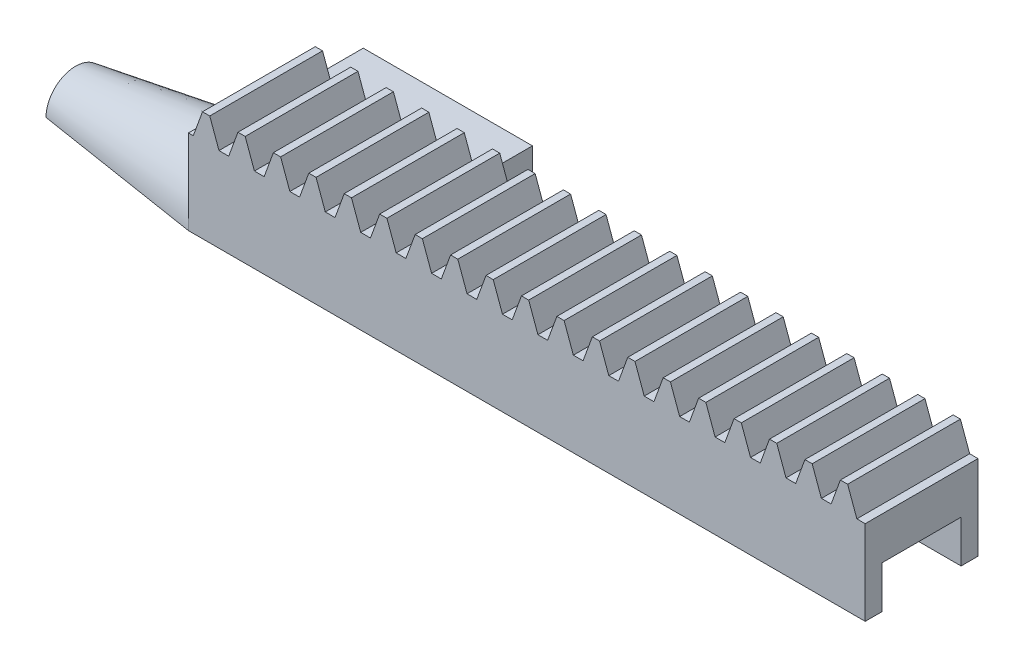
from build123d import *

# Parameters (mm, degrees)
BLANKSKE_W          = 120
BLANKSKE_H          = 12
BLANK_DEPTH         = 20
TOOTHCUTSIM_DEPTH   = 123.245654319
TEETHCUTS_COUNT     = 20
TEETHCUTS_PITCH     = 6.2831853
SKETCH_1_W          = 120
SKETCH_1_H          = 3
EXTRUDE_1_DEPTH     = 7.5
EXTRUDE_3_DEPTH     = 30
SKETCH_6_R          = 10
EXTRUDE_4_DEPTH     = 30
EXTRUDE_4_TAPER     = 9
CUT_EXTRUDE_1_DEPTH = 30
SKETCH_9_R          = 3.5
CUT_EXTRUDE_2_DEPTH = 30
CUT_EXTRUDE_2_DRAFT = 5


with BuildPart() as part:
    # BlankSke → Blank (new body)
    with BuildSketch(Plane.XY):
        with Locations((60, 6)):
            Rectangle(BLANKSKE_W, BLANKSKE_H)
    extrude(amount=-BLANK_DEPTH)

    # TooCutSkeSim → ToothCutSim (cut, through all)
    with BuildSketch(Plane.XY):
        Polygon((0.861870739, 7.5), (-0.861870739, 7.5), (-2.508981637, 12.0254), (2.508981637, 12.0254), align=None)
    toothcutsim = extrude(amount=-TOOTHCUTSIM_DEPTH, mode=Mode.SUBTRACT)

    # TeethCuts: ToothCutSim ×20
    with Locations(*[(i * TEETHCUTS_PITCH, 0, 0) for i in range(1, TEETHCUTS_COUNT)]):
        add(toothcutsim, mode=Mode.SUBTRACT)

    # Sketch 1 → Extrude 1 (add)
    with BuildSketch(Plane.XZ):
        with Locations((60, -18.5)):
            Rectangle(SKETCH_1_W, SKETCH_1_H)
        with Locations((60, -1.5)):
            Rectangle(SKETCH_1_W, SKETCH_1_H)
    extrude(amount=EXTRUDE_1_DEPTH)

    # Sketch 5 → Extrude 3 (add)
    with BuildSketch(Plane.ZY):
        Polygon((-20, 0.019237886), (-20, 5.019237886), (-31, 5.019237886), (-31, -3.480762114), (-24, -3.480762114), (-24, 0.019237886), align=None)
    extrude(amount=-EXTRUDE_3_DEPTH)

    # Sketch 6 → Extrude 4 (add)
    with BuildSketch(Plane.ZY):
        with Locations((-10, -7.5)):
            Circle(SKETCH_6_R)
    extrude(amount=EXTRUDE_4_DEPTH, taper=EXTRUDE_4_TAPER)

    # Sketch 7 → Cut-Extrude 1 (cut)
    with BuildSketch(Plane.ZY.offset(30)):
        Polygon((-25.046793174, -7.5), (-14.040000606, -25.260740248), (5.014769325, -25.260740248), (6.908411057, -7.5), align=None)
    extrude(amount=-CUT_EXTRUDE_1_DEPTH, mode=Mode.SUBTRACT)


with BuildPart() as cut_extrude_2_tool:
    # Sketch 9 → Cut-Extrude 2 (with draft: the straight prism first)
    with BuildSketch(Plane.ZY.offset(30)):
        with Locations((-10, -7.5)):
            Circle(SKETCH_9_R)
    extrude(amount=-CUT_EXTRUDE_2_DEPTH)
    # Cut-Extrude 2: the draft: its side faces are tilted about the plane it starts from
    cut_extrude_2_sides = [cut_extrude_2_tool.faces().sort_by_distance(p)[0] for p in [
        (-15, -7.5, -13.5),
    ]]
    draft(cut_extrude_2_sides, Plane.ZY.offset(30), CUT_EXTRUDE_2_DRAFT)


with BuildPart() as part_1:
    add(part.part)

    # Cut-Extrude 2: cut by cut_extrude_2_tool
    add(cut_extrude_2_tool.part, mode=Mode.SUBTRACT)


solid = part_1.part
